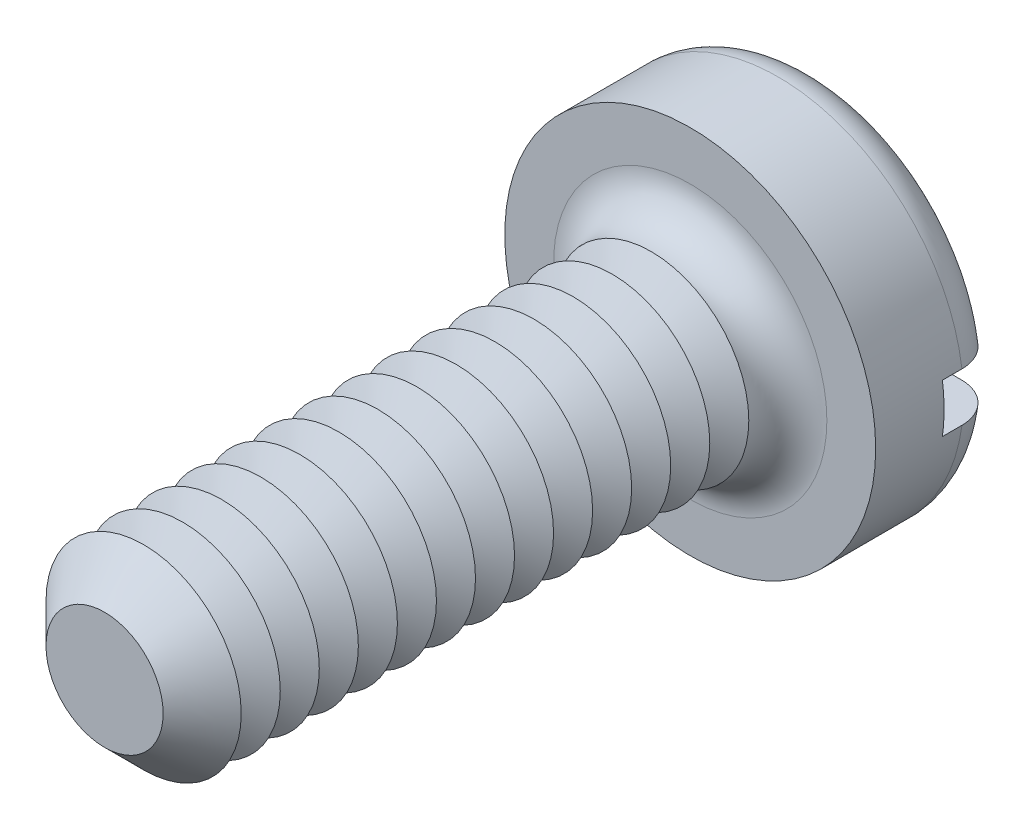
from build123d import *

# Parameters (mm, degrees)
SKETCH3_R           = 1.9
BOSS_EXTRUDE2_DEPTH = 1.3
SKETCH4_R           = 1
BOSS_EXTRUDE3_DEPTH = 6
FILLET1_R           = 0.4
CHAMFER1_SIZE       = 0.4
LPATTERN1_COUNT     = 13
LPATTERN1_PITCH     = 0.4
SKETCH8_W           = 3.8
SKETCH8_H           = 0.5
CUT_EXTRUDE1_DEPTH  = 0.6


with BuildPart() as part:
    # Sketch3 → Boss-Extrude2 (new body)
    with BuildSketch(Plane.XY):
        Circle(SKETCH3_R)
    extrude(amount=-BOSS_EXTRUDE2_DEPTH)

    # Sketch4 → Boss-Extrude3 (add)
    with BuildSketch(Plane.XY):
        Circle(SKETCH4_R)
    extrude(amount=BOSS_EXTRUDE3_DEPTH)

    # Fillet1
    fillet1_edges = [part.edges().sort_by_distance(p)[0] for p in [
        (-1.9, 0, -1.3),
        (-1, 0, 0),
    ]]
    fillet(fillet1_edges, radius=FILLET1_R)

    # Chamfer1
    chamfer1_edges = [part.edges().sort_by_distance(p)[0] for p in [
        (-1, 0, 6),
    ]]
    chamfer(chamfer1_edges, length=CHAMFER1_SIZE)

    # Sketch6 → Cut-Revolve1 (revolve, cut)
    with BuildSketch(Plane(origin=(0, 0, 0), x_dir=(0, 0, -1), z_dir=(1, 0, 0)), mode=Mode.PRIVATE) as cut_revolve1_sk:
        Polygon((-0.4, 1), (-0.6, 0.653589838), (-0.8, 1), align=None)
    cut_revolve1 = revolve(cut_revolve1_sk.sketch.rotate(Axis((0, 0, -1.694361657), (0, 0, 1)), 90), axis=Axis((0, 0, -1.694361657), (0, 0, 1)), mode=Mode.SUBTRACT)

    # LPattern1: Cut-Revolve1 ×13
    with Locations(*[(0, 0, i * LPATTERN1_PITCH) for i in range(1, LPATTERN1_COUNT)]):
        add(cut_revolve1, mode=Mode.SUBTRACT)

    # Sketch8 → Cut-Extrude1 (cut)
    with BuildSketch(Plane(origin=(0, 0, -1.3), x_dir=(-1, 0, 0), z_dir=(0, 0, -1))):
        Rectangle(SKETCH8_W, SKETCH8_H)
    extrude(amount=-CUT_EXTRUDE1_DEPTH, mode=Mode.SUBTRACT)


solid = part.part
